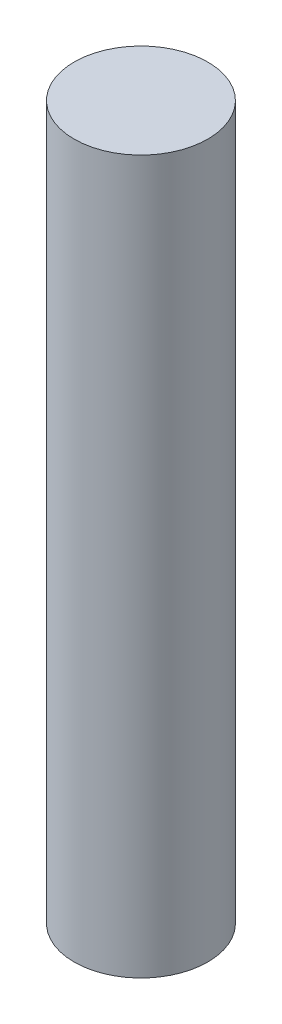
from build123d import *

# Parameters (mm, degrees)
SKETCH1_R           = 1.5
BOSS_EXTRUDE1_DEPTH = 8


with BuildPart() as part:
    # Sketch1 → Boss-Extrude1 (new, symmetric)
    with BuildSketch(Plane(origin=(0, 0, 0), x_dir=(1, 0, 0), z_dir=(0, 1, 0))):
        with Locations(Location((0, 0, 0), (0, 0, 270))):
            Circle(SKETCH1_R)
    extrude(amount=BOSS_EXTRUDE1_DEPTH, both=True)


solid = part.part
